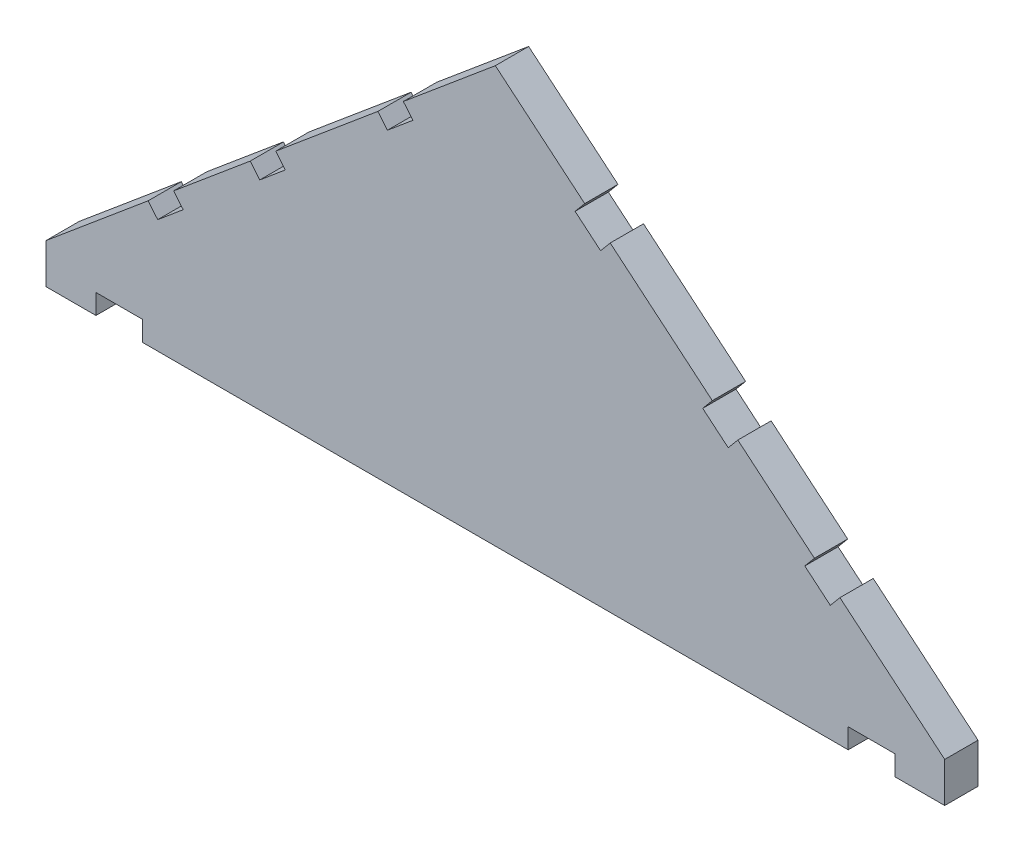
ISO-10303-21;
HEADER;
FILE_DESCRIPTION(('STEP AP214'),'2;1');
FILE_NAME('part.step','',(''),(''),'','','');
FILE_SCHEMA(('AUTOMOTIVE_DESIGN { 1 0 10303 214 1 1 1 1 }'));
ENDSEC;
DATA;
#1=APPLICATION_CONTEXT('core data for automotive mechanical design processes');
#2=APPLICATION_PROTOCOL_DEFINITION('international standard','automotive_design',2000,#1);
#3=PRODUCT_CONTEXT('',#1,'mechanical');
#4=PRODUCT('Part','Part','',(#3));
#5=PRODUCT_RELATED_PRODUCT_CATEGORY('part','',(#4));
#6=PRODUCT_DEFINITION_FORMATION('','',#4);
#7=PRODUCT_DEFINITION_CONTEXT('part definition',#1,'design');
#8=PRODUCT_DEFINITION('design','',#6,#7);
#9=PRODUCT_DEFINITION_SHAPE('','',#8);
#10=(LENGTH_UNIT() NAMED_UNIT(*) SI_UNIT(.MILLI.,.METRE.));
#11=(NAMED_UNIT(*) PLANE_ANGLE_UNIT() SI_UNIT($,.RADIAN.));
#12=(NAMED_UNIT(*) SI_UNIT($,.STERADIAN.) SOLID_ANGLE_UNIT());
#13=UNCERTAINTY_MEASURE_WITH_UNIT(LENGTH_MEASURE(1.E-05),#10,'distance_accuracy_value','');
#14=(GEOMETRIC_REPRESENTATION_CONTEXT(3) GLOBAL_UNCERTAINTY_ASSIGNED_CONTEXT((#13)) GLOBAL_UNIT_ASSIGNED_CONTEXT((#10,
#11,#12)) REPRESENTATION_CONTEXT('',''));
#15=CARTESIAN_POINT('',(0.,0.,0.));
#16=DIRECTION('',(0.,0.,1.));
#17=DIRECTION('',(1.,0.,0.));
#18=AXIS2_PLACEMENT_3D('',#15,#16,#17);
#19=CARTESIAN_POINT('',(68.4045773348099,-44.4964931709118,394.624391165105));
#20=DIRECTION('',(0.641858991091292,0.766822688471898,0.));
#21=DIRECTION('',(-0.766822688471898,0.641858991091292,0.));
#22=AXIS2_PLACEMENT_3D('',#19,#20,#21);
#23=PLANE('',#22);
#24=DIRECTION('',(0.,0.,1.));
#25=VECTOR('',#24,1.);
#26=CARTESIAN_POINT('',(171.925640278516,-131.147456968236,0.));
#27=LINE('',#26,#25);
#28=CARTESIAN_POINT('',(171.925640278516,-131.147456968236,0.));
#29=VERTEX_POINT('',#28);
#30=CARTESIAN_POINT('',(171.925640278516,-131.147456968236,10.));
#31=VERTEX_POINT('',#30);
#32=EDGE_CURVE('E926',#29,#31,#27,.T.);
#33=ORIENTED_EDGE('',*,*,#32,.T.);
#34=DIRECTION('',(0.766822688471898,-0.641858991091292,0.));
#35=VECTOR('',#34,1.);
#36=CARTESIAN_POINT('',(-10.9777224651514,21.9494318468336,10.));
#37=LINE('',#36,#35);
#38=CARTESIAN_POINT('',(203.40457733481,-157.496493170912,10.));
#39=VERTEX_POINT('',#38);
#40=EDGE_CURVE('E452',#31,#39,#37,.T.);
#41=ORIENTED_EDGE('',*,*,#40,.T.);
#42=DIRECTION('',(0.,0.,-1.));
#43=VECTOR('',#42,1.);
#44=CARTESIAN_POINT('',(203.40457733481,-157.496493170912,394.624391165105));
#45=LINE('',#44,#43);
#46=CARTESIAN_POINT('',(203.40457733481,-157.496493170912,0.));
#47=VERTEX_POINT('',#46);
#48=EDGE_CURVE('E445',#39,#47,#45,.T.);
#49=ORIENTED_EDGE('',*,*,#48,.T.);
#50=DIRECTION('',(0.766822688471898,-0.641858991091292,0.));
#51=VECTOR('',#50,1.);
#52=CARTESIAN_POINT('',(-10.9777224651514,21.9494318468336,0.));
#53=LINE('',#52,#51);
#54=EDGE_CURVE('E296',#29,#47,#53,.T.);
#55=ORIENTED_EDGE('',*,*,#54,.F.);
#56=EDGE_LOOP('',(#33,#41,#49,#55));
#57=FACE_BOUND('',#56,.T.);
#58=ADVANCED_FACE('F30',(#57),#23,.T.);
#59=DIRECTION('',(0.,0.,1.));
#60=VECTOR('',#59,1.);
#61=CARTESIAN_POINT('',(164.257413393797,-124.728867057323,0.));
#62=LINE('',#61,#60);
#63=CARTESIAN_POINT('',(164.257413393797,-124.728867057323,0.));
#64=VERTEX_POINT('',#63);
#65=CARTESIAN_POINT('',(164.257413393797,-124.728867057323,10.));
#66=VERTEX_POINT('',#65);
#67=EDGE_CURVE('E272',#64,#66,#62,.T.);
#68=ORIENTED_EDGE('',*,*,#67,.F.);
#69=CARTESIAN_POINT('',(141.25273273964,-105.473097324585,0.));
#70=VERTEX_POINT('',#69);
#71=EDGE_CURVE('E284',#70,#64,#53,.T.);
#72=ORIENTED_EDGE('',*,*,#71,.F.);
#73=DIRECTION('',(0.,0.,1.));
#74=VECTOR('',#73,1.);
#75=CARTESIAN_POINT('',(141.25273273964,-105.473097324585,0.));
#76=LINE('',#75,#74);
#77=CARTESIAN_POINT('',(141.25273273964,-105.473097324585,10.));
#78=VERTEX_POINT('',#77);
#79=EDGE_CURVE('E943',#70,#78,#76,.T.);
#80=ORIENTED_EDGE('',*,*,#79,.T.);
#81=EDGE_CURVE('E286',#78,#66,#37,.T.);
#82=ORIENTED_EDGE('',*,*,#81,.T.);
#83=EDGE_LOOP('',(#68,#72,#80,#82));
#84=FACE_BOUND('',#83,.T.);
#85=ADVANCED_FACE('F282',(#84),#23,.T.);
#86=CARTESIAN_POINT('',(-66.5954226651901,-44.4964931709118,10.));
#87=DIRECTION('',(0.,0.,-1.));
#88=DIRECTION('',(-1.,0.,0.));
#89=AXIS2_PLACEMENT_3D('',#86,#87,#88);
#90=PLANE('',#89);
#91=ORIENTED_EDGE('',*,*,#40,.F.);
#92=DIRECTION('',(0.641858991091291,0.766822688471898,0.));
#93=VECTOR('',#92,1.);
#94=CARTESIAN_POINT('',(169.037274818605,-134.59815906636,10.));
#95=LINE('',#94,#93);
#96=CARTESIAN_POINT('',(169.037274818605,-134.59815906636,10.));
#97=VERTEX_POINT('',#96);
#98=EDGE_CURVE('E277',#97,#31,#95,.T.);
#99=ORIENTED_EDGE('',*,*,#98,.F.);
#100=DIRECTION('',(0.766822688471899,-0.64185899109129,0.));
#101=VECTOR('',#100,1.);
#102=CARTESIAN_POINT('',(161.369047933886,-128.179569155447,10.));
#103=LINE('',#102,#101);
#104=CARTESIAN_POINT('',(161.369047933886,-128.179569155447,10.));
#105=VERTEX_POINT('',#104);
#106=EDGE_CURVE('E917',#105,#97,#103,.T.);
#107=ORIENTED_EDGE('',*,*,#106,.F.);
#108=DIRECTION('',(-0.641858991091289,-0.7668226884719,0.));
#109=VECTOR('',#108,1.);
#110=CARTESIAN_POINT('',(164.257413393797,-124.728867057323,10.));
#111=LINE('',#110,#109);
#112=EDGE_CURVE('E921',#66,#105,#111,.T.);
#113=ORIENTED_EDGE('',*,*,#112,.F.);
#114=ORIENTED_EDGE('',*,*,#81,.F.);
#115=DIRECTION('',(0.641858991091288,0.766822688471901,0.));
#116=VECTOR('',#115,1.);
#117=CARTESIAN_POINT('',(138.364367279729,-108.923799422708,10.));
#118=LINE('',#117,#116);
#119=CARTESIAN_POINT('',(138.364367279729,-108.923799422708,10.));
#120=VERTEX_POINT('',#119);
#121=EDGE_CURVE('E933',#120,#78,#118,.T.);
#122=ORIENTED_EDGE('',*,*,#121,.F.);
#123=DIRECTION('',(0.766822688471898,-0.641858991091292,0.));
#124=VECTOR('',#123,1.);
#125=CARTESIAN_POINT('',(130.69614039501,-102.505209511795,10.));
#126=LINE('',#125,#124);
#127=CARTESIAN_POINT('',(130.69614039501,-102.505209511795,10.));
#128=VERTEX_POINT('',#127);
#129=EDGE_CURVE('E939',#128,#120,#126,.T.);
#130=ORIENTED_EDGE('',*,*,#129,.F.);
#131=DIRECTION('',(-0.641858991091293,-0.766822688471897,0.));
#132=VECTOR('',#131,1.);
#133=CARTESIAN_POINT('',(133.584505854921,-99.0545074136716,10.));
#134=LINE('',#133,#132);
#135=CARTESIAN_POINT('',(133.584505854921,-99.0545074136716,10.));
#136=VERTEX_POINT('',#135);
#137=EDGE_CURVE('E928',#136,#128,#134,.T.);
#138=ORIENTED_EDGE('',*,*,#137,.F.);
#139=CARTESIAN_POINT('',(102.911598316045,-73.3801477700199,10.));
#140=VERTEX_POINT('',#139);
#141=EDGE_CURVE('E455',#140,#136,#37,.T.);
#142=ORIENTED_EDGE('',*,*,#141,.F.);
#143=DIRECTION('',(0.64185899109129,0.7668226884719,0.));
#144=VECTOR('',#143,1.);
#145=CARTESIAN_POINT('',(47.2938981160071,-139.826072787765,10.));
#146=LINE('',#145,#144);
#147=CARTESIAN_POINT('',(100.023232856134,-76.8308498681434,10.));
#148=VERTEX_POINT('',#147);
#149=EDGE_CURVE('E536',#148,#140,#146,.T.);
#150=ORIENTED_EDGE('',*,*,#149,.F.);
#151=DIRECTION('',(0.7668226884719,-0.641858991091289,0.));
#152=VECTOR('',#151,1.);
#153=CARTESIAN_POINT('',(-13.8660879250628,18.4987297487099,10.));
#154=LINE('',#153,#152);
#155=CARTESIAN_POINT('',(92.3550059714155,-70.4122599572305,10.));
#156=VERTEX_POINT('',#155);
#157=EDGE_CURVE('E530',#156,#148,#154,.T.);
#158=ORIENTED_EDGE('',*,*,#157,.F.);
#159=DIRECTION('',(-0.641858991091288,-0.766822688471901,0.));
#160=VECTOR('',#159,1.);
#161=CARTESIAN_POINT('',(39.6256712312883,-133.407482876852,10.));
#162=LINE('',#161,#160);
#163=CARTESIAN_POINT('',(95.2433714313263,-66.961557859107,10.));
#164=VERTEX_POINT('',#163);
#165=EDGE_CURVE('E528',#164,#156,#162,.T.);
#166=ORIENTED_EDGE('',*,*,#165,.F.);
#167=CARTESIAN_POINT('',(68.4045773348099,-44.4964931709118,10.));
#168=VERTEX_POINT('',#167);
#169=EDGE_CURVE('E320',#168,#164,#37,.T.);
#170=ORIENTED_EDGE('',*,*,#169,.F.);
#171=DIRECTION('',(0.766822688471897,0.641858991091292,0.));
#172=VECTOR('',#171,1.);
#173=CARTESIAN_POINT('',(-10.9777224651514,-110.942418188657,10.));
#174=LINE('',#173,#172);
#175=CARTESIAN_POINT('',(40.7597537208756,-67.6362344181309,10.));
#176=VERTEX_POINT('',#175);
#177=EDGE_CURVE('E454',#176,#168,#174,.T.);
#178=ORIENTED_EDGE('',*,*,#177,.F.);
#179=DIRECTION('',(-0.641858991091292,0.766822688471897,0.));
#180=VECTOR('',#179,1.);
#181=CARTESIAN_POINT('',(40.7597537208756,-67.6362344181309,10.));
#182=LINE('',#181,#180);
#183=CARTESIAN_POINT('',(43.6481191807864,-71.0869365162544,10.));
#184=VERTEX_POINT('',#183);
#185=EDGE_CURVE('E543',#184,#176,#182,.T.);
#186=ORIENTED_EDGE('',*,*,#185,.F.);
#187=DIRECTION('',(0.766822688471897,0.641858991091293,0.));
#188=VECTOR('',#187,1.);
#189=CARTESIAN_POINT('',(43.6481191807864,-71.0869365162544,10.));
#190=LINE('',#189,#188);
#191=CARTESIAN_POINT('',(35.9798922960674,-77.5055264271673,10.));
#192=VERTEX_POINT('',#191);
#193=EDGE_CURVE('E549',#192,#184,#190,.T.);
#194=ORIENTED_EDGE('',*,*,#193,.F.);
#195=DIRECTION('',(0.641858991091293,-0.766822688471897,0.));
#196=VECTOR('',#195,1.);
#197=CARTESIAN_POINT('',(35.9798922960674,-77.5055264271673,10.));
#198=LINE('',#197,#196);
#199=CARTESIAN_POINT('',(33.0915268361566,-74.0548243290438,10.));
#200=VERTEX_POINT('',#199);
#201=EDGE_CURVE('E534',#200,#192,#198,.T.);
#202=ORIENTED_EDGE('',*,*,#201,.F.);
#203=CARTESIAN_POINT('',(2.41861929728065,-99.7291839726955,10.));
#204=VERTEX_POINT('',#203);
#205=EDGE_CURVE('E518',#204,#200,#174,.T.);
#206=ORIENTED_EDGE('',*,*,#205,.F.);
#207=DIRECTION('',(-0.641858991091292,0.766822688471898,0.));
#208=VECTOR('',#207,1.);
#209=CARTESIAN_POINT('',(2.41861929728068,-99.7291839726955,10.));
#210=LINE('',#209,#208);
#211=CARTESIAN_POINT('',(5.30698475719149,-103.179886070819,10.));
#212=VERTEX_POINT('',#211);
#213=EDGE_CURVE('E368',#212,#204,#210,.T.);
#214=ORIENTED_EDGE('',*,*,#213,.F.);
#215=DIRECTION('',(0.766822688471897,0.641858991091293,0.));
#216=VECTOR('',#215,1.);
#217=CARTESIAN_POINT('',(5.30698475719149,-103.179886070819,10.));
#218=LINE('',#217,#216);
#219=CARTESIAN_POINT('',(-2.36124212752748,-109.598475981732,10.));
#220=VERTEX_POINT('',#219);
#221=EDGE_CURVE('E563',#220,#212,#218,.T.);
#222=ORIENTED_EDGE('',*,*,#221,.F.);
#223=DIRECTION('',(0.64185899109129,-0.766822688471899,0.));
#224=VECTOR('',#223,1.);
#225=CARTESIAN_POINT('',(-2.36124212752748,-109.598475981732,10.));
#226=LINE('',#225,#224);
#227=CARTESIAN_POINT('',(-5.24960758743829,-106.147773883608,10.));
#228=VERTEX_POINT('',#227);
#229=EDGE_CURVE('E517',#228,#220,#226,.T.);
#230=ORIENTED_EDGE('',*,*,#229,.F.);
#231=CARTESIAN_POINT('',(-28.2542882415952,-125.403543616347,10.));
#232=VERTEX_POINT('',#231);
#233=EDGE_CURVE('E354',#232,#228,#174,.T.);
#234=ORIENTED_EDGE('',*,*,#233,.F.);
#235=DIRECTION('',(-0.641858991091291,0.766822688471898,0.));
#236=VECTOR('',#235,1.);
#237=CARTESIAN_POINT('',(-28.2542882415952,-125.403543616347,10.));
#238=LINE('',#237,#236);
#239=CARTESIAN_POINT('',(-25.3659227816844,-128.854245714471,10.));
#240=VERTEX_POINT('',#239);
#241=EDGE_CURVE('E379',#240,#232,#238,.T.);
#242=ORIENTED_EDGE('',*,*,#241,.F.);
#243=DIRECTION('',(0.766822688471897,0.641858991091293,0.));
#244=VECTOR('',#243,1.);
#245=CARTESIAN_POINT('',(-25.3659227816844,-128.854245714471,10.));
#246=LINE('',#245,#244);
#247=CARTESIAN_POINT('',(-33.0341496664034,-135.272835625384,10.));
#248=VERTEX_POINT('',#247);
#249=EDGE_CURVE('E362',#248,#240,#246,.T.);
#250=ORIENTED_EDGE('',*,*,#249,.F.);
#251=DIRECTION('',(0.641858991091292,-0.766822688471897,0.));
#252=VECTOR('',#251,1.);
#253=CARTESIAN_POINT('',(-33.0341496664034,-135.272835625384,10.));
#254=LINE('',#253,#252);
#255=CARTESIAN_POINT('',(-35.9225151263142,-131.82213352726,10.));
#256=VERTEX_POINT('',#255);
#257=EDGE_CURVE('E358',#256,#248,#254,.T.);
#258=ORIENTED_EDGE('',*,*,#257,.F.);
#259=CARTESIAN_POINT('',(-66.5954226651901,-157.496493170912,10.));
#260=VERTEX_POINT('',#259);
#261=EDGE_CURVE('E456',#260,#256,#174,.T.);
#262=ORIENTED_EDGE('',*,*,#261,.F.);
#263=DIRECTION('',(0.,-1.,0.));
#264=VECTOR('',#263,1.);
#265=CARTESIAN_POINT('',(-66.5954226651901,-169.496493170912,10.));
#266=LINE('',#265,#264);
#267=CARTESIAN_POINT('',(-66.5954226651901,-169.496493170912,10.));
#268=VERTEX_POINT('',#267);
#269=EDGE_CURVE('E460',#260,#268,#266,.T.);
#270=ORIENTED_EDGE('',*,*,#269,.T.);
#271=DIRECTION('',(1.,0.,0.));
#272=VECTOR('',#271,1.);
#273=CARTESIAN_POINT('',(-66.5954226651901,-169.496493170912,10.));
#274=LINE('',#273,#272);
#275=CARTESIAN_POINT('',(-51.5954226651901,-169.496493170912,10.));
#276=VERTEX_POINT('',#275);
#277=EDGE_CURVE('E464',#268,#276,#274,.T.);
#278=ORIENTED_EDGE('',*,*,#277,.T.);
#279=DIRECTION('',(0.,-1.,0.));
#280=VECTOR('',#279,1.);
#281=CARTESIAN_POINT('',(-51.5954226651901,-169.496493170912,10.));
#282=LINE('',#281,#280);
#283=CARTESIAN_POINT('',(-51.5954226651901,-163.496493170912,10.));
#284=VERTEX_POINT('',#283);
#285=EDGE_CURVE('E412',#284,#276,#282,.T.);
#286=ORIENTED_EDGE('',*,*,#285,.F.);
#287=DIRECTION('',(-1.,0.,0.));
#288=VECTOR('',#287,1.);
#289=CARTESIAN_POINT('',(-51.5954226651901,-163.496493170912,10.));
#290=LINE('',#289,#288);
#291=CARTESIAN_POINT('',(-37.5954226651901,-163.496493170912,10.));
#292=VERTEX_POINT('',#291);
#293=EDGE_CURVE('E423',#292,#284,#290,.T.);
#294=ORIENTED_EDGE('',*,*,#293,.F.);
#295=DIRECTION('',(0.,1.,0.));
#296=VECTOR('',#295,1.);
#297=CARTESIAN_POINT('',(-37.5954226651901,-169.496493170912,10.));
#298=LINE('',#297,#296);
#299=CARTESIAN_POINT('',(-37.5954226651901,-169.496493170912,10.));
#300=VERTEX_POINT('',#299);
#301=EDGE_CURVE('E431',#300,#292,#298,.T.);
#302=ORIENTED_EDGE('',*,*,#301,.F.);
#303=CARTESIAN_POINT('',(174.40457733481,-169.496493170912,10.));
#304=VERTEX_POINT('',#303);
#305=EDGE_CURVE('E468',#300,#304,#274,.T.);
#306=ORIENTED_EDGE('',*,*,#305,.T.);
#307=DIRECTION('',(0.,-1.,0.));
#308=VECTOR('',#307,1.);
#309=CARTESIAN_POINT('',(174.40457733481,-169.496493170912,10.));
#310=LINE('',#309,#308);
#311=CARTESIAN_POINT('',(174.40457733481,-163.496493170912,10.));
#312=VERTEX_POINT('',#311);
#313=EDGE_CURVE('E388',#312,#304,#310,.T.);
#314=ORIENTED_EDGE('',*,*,#313,.F.);
#315=DIRECTION('',(-1.,0.,0.));
#316=VECTOR('',#315,1.);
#317=CARTESIAN_POINT('',(174.40457733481,-163.496493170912,10.));
#318=LINE('',#317,#316);
#319=CARTESIAN_POINT('',(188.40457733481,-163.496493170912,10.));
#320=VERTEX_POINT('',#319);
#321=EDGE_CURVE('E397',#320,#312,#318,.T.);
#322=ORIENTED_EDGE('',*,*,#321,.F.);
#323=DIRECTION('',(0.,1.,0.));
#324=VECTOR('',#323,1.);
#325=CARTESIAN_POINT('',(188.40457733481,-169.496493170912,10.));
#326=LINE('',#325,#324);
#327=CARTESIAN_POINT('',(188.40457733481,-169.496493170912,10.));
#328=VERTEX_POINT('',#327);
#329=EDGE_CURVE('E405',#328,#320,#326,.T.);
#330=ORIENTED_EDGE('',*,*,#329,.F.);
#331=CARTESIAN_POINT('',(203.40457733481,-169.496493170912,10.));
#332=VERTEX_POINT('',#331);
#333=EDGE_CURVE('E462',#328,#332,#274,.T.);
#334=ORIENTED_EDGE('',*,*,#333,.T.);
#335=DIRECTION('',(0.,1.,0.));
#336=VECTOR('',#335,1.);
#337=CARTESIAN_POINT('',(203.40457733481,-169.496493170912,10.));
#338=LINE('',#337,#336);
#339=EDGE_CURVE('E467',#332,#39,#338,.T.);
#340=ORIENTED_EDGE('',*,*,#339,.T.);
#341=EDGE_LOOP('',(#91,#99,#107,#113,#114,#122,#130,#138,#142,#150,#158,#166,#170,#178,#186,
#194,#202,#206,#214,#222,#230,#234,#242,#250,#258,#262,#270,#278,#286,#294,#302,#306,#314,#322,
#330,#334,#340));
#342=FACE_BOUND('',#341,.T.);
#343=ADVANCED_FACE('F500',(#342),#90,.F.);
#344=CARTESIAN_POINT('',(-66.5954226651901,-44.4964931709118,0.));
#345=DIRECTION('',(0.,0.,-1.));
#346=DIRECTION('',(-1.,0.,0.));
#347=AXIS2_PLACEMENT_3D('',#344,#345,#346);
#348=PLANE('',#347);
#349=DIRECTION('',(0.641858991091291,0.766822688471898,0.));
#350=VECTOR('',#349,1.);
#351=CARTESIAN_POINT('',(169.037274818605,-134.59815906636,0.));
#352=LINE('',#351,#350);
#353=CARTESIAN_POINT('',(169.037274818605,-134.59815906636,0.));
#354=VERTEX_POINT('',#353);
#355=EDGE_CURVE('E287',#354,#29,#352,.T.);
#356=ORIENTED_EDGE('',*,*,#355,.T.);
#357=ORIENTED_EDGE('',*,*,#54,.T.);
#358=DIRECTION('',(0.,1.,0.));
#359=VECTOR('',#358,1.);
#360=CARTESIAN_POINT('',(203.40457733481,-169.496493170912,0.));
#361=LINE('',#360,#359);
#362=CARTESIAN_POINT('',(203.40457733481,-169.496493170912,0.));
#363=VERTEX_POINT('',#362);
#364=EDGE_CURVE('E463',#363,#47,#361,.T.);
#365=ORIENTED_EDGE('',*,*,#364,.F.);
#366=DIRECTION('',(1.,0.,0.));
#367=VECTOR('',#366,1.);
#368=CARTESIAN_POINT('',(-66.5954226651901,-169.496493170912,0.));
#369=LINE('',#368,#367);
#370=CARTESIAN_POINT('',(188.40457733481,-169.496493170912,0.));
#371=VERTEX_POINT('',#370);
#372=EDGE_CURVE('E473',#371,#363,#369,.T.);
#373=ORIENTED_EDGE('',*,*,#372,.F.);
#374=DIRECTION('',(0.,1.,0.));
#375=VECTOR('',#374,1.);
#376=CARTESIAN_POINT('',(188.40457733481,-169.496493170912,0.));
#377=LINE('',#376,#375);
#378=CARTESIAN_POINT('',(188.40457733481,-163.496493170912,0.));
#379=VERTEX_POINT('',#378);
#380=EDGE_CURVE('E396',#371,#379,#377,.T.);
#381=ORIENTED_EDGE('',*,*,#380,.T.);
#382=DIRECTION('',(-1.,0.,0.));
#383=VECTOR('',#382,1.);
#384=CARTESIAN_POINT('',(174.40457733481,-163.496493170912,0.));
#385=LINE('',#384,#383);
#386=CARTESIAN_POINT('',(174.40457733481,-163.496493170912,0.));
#387=VERTEX_POINT('',#386);
#388=EDGE_CURVE('E400',#379,#387,#385,.T.);
#389=ORIENTED_EDGE('',*,*,#388,.T.);
#390=DIRECTION('',(0.,-1.,0.));
#391=VECTOR('',#390,1.);
#392=CARTESIAN_POINT('',(174.40457733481,-169.496493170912,0.));
#393=LINE('',#392,#391);
#394=CARTESIAN_POINT('',(174.40457733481,-169.496493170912,0.));
#395=VERTEX_POINT('',#394);
#396=EDGE_CURVE('E393',#387,#395,#393,.T.);
#397=ORIENTED_EDGE('',*,*,#396,.T.);
#398=CARTESIAN_POINT('',(-37.5954226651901,-169.496493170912,0.));
#399=VERTEX_POINT('',#398);
#400=EDGE_CURVE('E477',#399,#395,#369,.T.);
#401=ORIENTED_EDGE('',*,*,#400,.F.);
#402=DIRECTION('',(0.,1.,0.));
#403=VECTOR('',#402,1.);
#404=CARTESIAN_POINT('',(-37.5954226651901,-169.496493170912,0.));
#405=LINE('',#404,#403);
#406=CARTESIAN_POINT('',(-37.5954226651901,-163.496493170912,0.));
#407=VERTEX_POINT('',#406);
#408=EDGE_CURVE('E422',#399,#407,#405,.T.);
#409=ORIENTED_EDGE('',*,*,#408,.T.);
#410=DIRECTION('',(-1.,0.,0.));
#411=VECTOR('',#410,1.);
#412=CARTESIAN_POINT('',(-51.5954226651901,-163.496493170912,0.));
#413=LINE('',#412,#411);
#414=CARTESIAN_POINT('',(-51.5954226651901,-163.496493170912,0.));
#415=VERTEX_POINT('',#414);
#416=EDGE_CURVE('E426',#407,#415,#413,.T.);
#417=ORIENTED_EDGE('',*,*,#416,.T.);
#418=DIRECTION('',(0.,-1.,0.));
#419=VECTOR('',#418,1.);
#420=CARTESIAN_POINT('',(-51.5954226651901,-169.496493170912,0.));
#421=LINE('',#420,#419);
#422=CARTESIAN_POINT('',(-51.5954226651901,-169.496493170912,0.));
#423=VERTEX_POINT('',#422);
#424=EDGE_CURVE('E419',#415,#423,#421,.T.);
#425=ORIENTED_EDGE('',*,*,#424,.T.);
#426=CARTESIAN_POINT('',(-66.5954226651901,-169.496493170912,0.));
#427=VERTEX_POINT('',#426);
#428=EDGE_CURVE('E474',#427,#423,#369,.T.);
#429=ORIENTED_EDGE('',*,*,#428,.F.);
#430=DIRECTION('',(0.,-1.,0.));
#431=VECTOR('',#430,1.);
#432=CARTESIAN_POINT('',(-66.5954226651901,-169.496493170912,0.));
#433=LINE('',#432,#431);
#434=CARTESIAN_POINT('',(-66.5954226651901,-157.496493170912,0.));
#435=VERTEX_POINT('',#434);
#436=EDGE_CURVE('E459',#435,#427,#433,.T.);
#437=ORIENTED_EDGE('',*,*,#436,.F.);
#438=DIRECTION('',(0.766822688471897,0.641858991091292,0.));
#439=VECTOR('',#438,1.);
#440=CARTESIAN_POINT('',(-10.9777224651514,-110.942418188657,0.));
#441=LINE('',#440,#439);
#442=CARTESIAN_POINT('',(-35.9225151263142,-131.82213352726,0.));
#443=VERTEX_POINT('',#442);
#444=EDGE_CURVE('E306',#435,#443,#441,.T.);
#445=ORIENTED_EDGE('',*,*,#444,.T.);
#446=DIRECTION('',(0.641858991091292,-0.766822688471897,0.));
#447=VECTOR('',#446,1.);
#448=CARTESIAN_POINT('',(-33.0341496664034,-135.272835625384,0.));
#449=LINE('',#448,#447);
#450=CARTESIAN_POINT('',(-33.0341496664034,-135.272835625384,0.));
#451=VERTEX_POINT('',#450);
#452=EDGE_CURVE('E375',#443,#451,#449,.T.);
#453=ORIENTED_EDGE('',*,*,#452,.T.);
#454=DIRECTION('',(0.766822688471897,0.641858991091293,0.));
#455=VECTOR('',#454,1.);
#456=CARTESIAN_POINT('',(-25.3659227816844,-128.854245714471,0.));
#457=LINE('',#456,#455);
#458=CARTESIAN_POINT('',(-25.3659227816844,-128.854245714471,0.));
#459=VERTEX_POINT('',#458);
#460=EDGE_CURVE('E378',#451,#459,#457,.T.);
#461=ORIENTED_EDGE('',*,*,#460,.T.);
#462=DIRECTION('',(-0.641858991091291,0.766822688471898,0.));
#463=VECTOR('',#462,1.);
#464=CARTESIAN_POINT('',(-28.2542882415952,-125.403543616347,0.));
#465=LINE('',#464,#463);
#466=CARTESIAN_POINT('',(-28.2542882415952,-125.403543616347,0.));
#467=VERTEX_POINT('',#466);
#468=EDGE_CURVE('E345',#459,#467,#465,.T.);
#469=ORIENTED_EDGE('',*,*,#468,.T.);
#470=CARTESIAN_POINT('',(-5.24960758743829,-106.147773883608,0.));
#471=VERTEX_POINT('',#470);
#472=EDGE_CURVE('E310',#467,#471,#441,.T.);
#473=ORIENTED_EDGE('',*,*,#472,.T.);
#474=DIRECTION('',(0.64185899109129,-0.766822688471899,0.));
#475=VECTOR('',#474,1.);
#476=CARTESIAN_POINT('',(-2.36124212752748,-109.598475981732,0.));
#477=LINE('',#476,#475);
#478=CARTESIAN_POINT('',(-2.36124212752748,-109.598475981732,0.));
#479=VERTEX_POINT('',#478);
#480=EDGE_CURVE('E342',#471,#479,#477,.T.);
#481=ORIENTED_EDGE('',*,*,#480,.T.);
#482=DIRECTION('',(0.766822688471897,0.641858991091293,0.));
#483=VECTOR('',#482,1.);
#484=CARTESIAN_POINT('',(5.30698475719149,-103.179886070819,0.));
#485=LINE('',#484,#483);
#486=CARTESIAN_POINT('',(5.30698475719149,-103.179886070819,0.));
#487=VERTEX_POINT('',#486);
#488=EDGE_CURVE('E560',#479,#487,#485,.T.);
#489=ORIENTED_EDGE('',*,*,#488,.T.);
#490=DIRECTION('',(-0.641858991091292,0.766822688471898,0.));
#491=VECTOR('',#490,1.);
#492=CARTESIAN_POINT('',(2.41861929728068,-99.7291839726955,0.));
#493=LINE('',#492,#491);
#494=CARTESIAN_POINT('',(2.41861929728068,-99.7291839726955,0.));
#495=VERTEX_POINT('',#494);
#496=EDGE_CURVE('E374',#487,#495,#493,.T.);
#497=ORIENTED_EDGE('',*,*,#496,.T.);
#498=CARTESIAN_POINT('',(33.0915268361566,-74.0548243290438,0.));
#499=VERTEX_POINT('',#498);
#500=EDGE_CURVE('E332',#495,#499,#441,.T.);
#501=ORIENTED_EDGE('',*,*,#500,.T.);
#502=DIRECTION('',(0.641858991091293,-0.766822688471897,0.));
#503=VECTOR('',#502,1.);
#504=CARTESIAN_POINT('',(35.9798922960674,-77.5055264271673,0.));
#505=LINE('',#504,#503);
#506=CARTESIAN_POINT('',(35.9798922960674,-77.5055264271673,0.));
#507=VERTEX_POINT('',#506);
#508=EDGE_CURVE('E540',#499,#507,#505,.T.);
#509=ORIENTED_EDGE('',*,*,#508,.T.);
#510=DIRECTION('',(0.766822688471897,0.641858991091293,0.));
#511=VECTOR('',#510,1.);
#512=CARTESIAN_POINT('',(43.6481191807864,-71.0869365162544,0.));
#513=LINE('',#512,#511);
#514=CARTESIAN_POINT('',(43.6481191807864,-71.0869365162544,0.));
#515=VERTEX_POINT('',#514);
#516=EDGE_CURVE('E542',#507,#515,#513,.T.);
#517=ORIENTED_EDGE('',*,*,#516,.T.);
#518=DIRECTION('',(-0.641858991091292,0.766822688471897,0.));
#519=VECTOR('',#518,1.);
#520=CARTESIAN_POINT('',(40.7597537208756,-67.6362344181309,0.));
#521=LINE('',#520,#519);
#522=CARTESIAN_POINT('',(40.7597537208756,-67.6362344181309,0.));
#523=VERTEX_POINT('',#522);
#524=EDGE_CURVE('E329',#515,#523,#521,.T.);
#525=ORIENTED_EDGE('',*,*,#524,.T.);
#526=CARTESIAN_POINT('',(68.4045773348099,-44.4964931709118,0.));
#527=VERTEX_POINT('',#526);
#528=EDGE_CURVE('E304',#523,#527,#441,.T.);
#529=ORIENTED_EDGE('',*,*,#528,.T.);
#530=CARTESIAN_POINT('',(95.2433714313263,-66.961557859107,0.));
#531=VERTEX_POINT('',#530);
#532=EDGE_CURVE('E299',#527,#531,#53,.T.);
#533=ORIENTED_EDGE('',*,*,#532,.T.);
#534=DIRECTION('',(-0.641858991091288,-0.766822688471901,0.));
#535=VECTOR('',#534,1.);
#536=CARTESIAN_POINT('',(39.6256712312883,-133.407482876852,0.));
#537=LINE('',#536,#535);
#538=CARTESIAN_POINT('',(92.3550059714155,-70.4122599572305,0.));
#539=VERTEX_POINT('',#538);
#540=EDGE_CURVE('E324',#531,#539,#537,.T.);
#541=ORIENTED_EDGE('',*,*,#540,.T.);
#542=DIRECTION('',(0.7668226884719,-0.641858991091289,0.));
#543=VECTOR('',#542,1.);
#544=CARTESIAN_POINT('',(-13.8660879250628,18.4987297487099,0.));
#545=LINE('',#544,#543);
#546=CARTESIAN_POINT('',(100.023232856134,-76.8308498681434,0.));
#547=VERTEX_POINT('',#546);
#548=EDGE_CURVE('E11',#539,#547,#545,.T.);
#549=ORIENTED_EDGE('',*,*,#548,.T.);
#550=DIRECTION('',(0.64185899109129,0.7668226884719,0.));
#551=VECTOR('',#550,1.);
#552=CARTESIAN_POINT('',(47.2938981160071,-139.826072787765,0.));
#553=LINE('',#552,#551);
#554=CARTESIAN_POINT('',(102.911598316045,-73.3801477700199,0.));
#555=VERTEX_POINT('',#554);
#556=EDGE_CURVE('E955',#547,#555,#553,.T.);
#557=ORIENTED_EDGE('',*,*,#556,.T.);
#558=CARTESIAN_POINT('',(133.584505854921,-99.0545074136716,0.));
#559=VERTEX_POINT('',#558);
#560=EDGE_CURVE('E295',#555,#559,#53,.T.);
#561=ORIENTED_EDGE('',*,*,#560,.T.);
#562=DIRECTION('',(-0.641858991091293,-0.766822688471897,0.));
#563=VECTOR('',#562,1.);
#564=CARTESIAN_POINT('',(133.584505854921,-99.0545074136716,0.));
#565=LINE('',#564,#563);
#566=CARTESIAN_POINT('',(130.69614039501,-102.505209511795,0.));
#567=VERTEX_POINT('',#566);
#568=EDGE_CURVE('E53',#559,#567,#565,.T.);
#569=ORIENTED_EDGE('',*,*,#568,.T.);
#570=DIRECTION('',(0.766822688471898,-0.641858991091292,0.));
#571=VECTOR('',#570,1.);
#572=CARTESIAN_POINT('',(130.69614039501,-102.505209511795,0.));
#573=LINE('',#572,#571);
#574=CARTESIAN_POINT('',(138.364367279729,-108.923799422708,0.));
#575=VERTEX_POINT('',#574);
#576=EDGE_CURVE('E932',#567,#575,#573,.T.);
#577=ORIENTED_EDGE('',*,*,#576,.T.);
#578=DIRECTION('',(0.641858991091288,0.766822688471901,0.));
#579=VECTOR('',#578,1.);
#580=CARTESIAN_POINT('',(138.364367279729,-108.923799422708,0.));
#581=LINE('',#580,#579);
#582=EDGE_CURVE('E294',#575,#70,#581,.T.);
#583=ORIENTED_EDGE('',*,*,#582,.T.);
#584=ORIENTED_EDGE('',*,*,#71,.T.);
#585=DIRECTION('',(-0.641858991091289,-0.7668226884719,0.));
#586=VECTOR('',#585,1.);
#587=CARTESIAN_POINT('',(164.257413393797,-124.728867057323,0.));
#588=LINE('',#587,#586);
#589=CARTESIAN_POINT('',(161.369047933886,-128.179569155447,0.));
#590=VERTEX_POINT('',#589);
#591=EDGE_CURVE('E268',#64,#590,#588,.T.);
#592=ORIENTED_EDGE('',*,*,#591,.T.);
#593=DIRECTION('',(0.766822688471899,-0.64185899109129,0.));
#594=VECTOR('',#593,1.);
#595=CARTESIAN_POINT('',(161.369047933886,-128.179569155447,0.));
#596=LINE('',#595,#594);
#597=EDGE_CURVE('E45',#590,#354,#596,.T.);
#598=ORIENTED_EDGE('',*,*,#597,.T.);
#599=EDGE_LOOP('',(#356,#357,#365,#373,#381,#389,#397,#401,#409,#417,#425,#429,#437,#445,#453,
#461,#469,#473,#481,#489,#497,#501,#509,#517,#525,#529,#533,#541,#549,#557,#561,#569,#577,#583,
#584,#592,#598));
#600=FACE_BOUND('',#599,.T.);
#601=ADVANCED_FACE('F291',(#600),#348,.T.);
#602=ORIENTED_EDGE('',*,*,#169,.T.);
#603=DIRECTION('',(0.,0.,-1.));
#604=VECTOR('',#603,1.);
#605=CARTESIAN_POINT('',(95.2433714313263,-66.961557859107,394.624391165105));
#606=LINE('',#605,#604);
#607=EDGE_CURVE('E38',#164,#531,#606,.T.);
#608=ORIENTED_EDGE('',*,*,#607,.T.);
#609=ORIENTED_EDGE('',*,*,#532,.F.);
#610=DIRECTION('',(0.,0.,-1.));
#611=VECTOR('',#610,1.);
#612=CARTESIAN_POINT('',(68.4045773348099,-44.4964931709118,394.624391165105));
#613=LINE('',#612,#611);
#614=EDGE_CURVE('E438',#168,#527,#613,.T.);
#615=ORIENTED_EDGE('',*,*,#614,.F.);
#616=EDGE_LOOP('',(#602,#608,#609,#615));
#617=FACE_BOUND('',#616,.T.);
#618=ADVANCED_FACE('F316',(#617),#23,.T.);
#619=DIRECTION('',(0.,0.,1.));
#620=VECTOR('',#619,1.);
#621=CARTESIAN_POINT('',(133.584505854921,-99.0545074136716,0.));
#622=LINE('',#621,#620);
#623=EDGE_CURVE('E936',#559,#136,#622,.T.);
#624=ORIENTED_EDGE('',*,*,#623,.F.);
#625=ORIENTED_EDGE('',*,*,#560,.F.);
#626=DIRECTION('',(0.,0.,1.));
#627=VECTOR('',#626,1.);
#628=CARTESIAN_POINT('',(102.911598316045,-73.3801477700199,394.624391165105));
#629=LINE('',#628,#627);
#630=EDGE_CURVE('E309',#555,#140,#629,.T.);
#631=ORIENTED_EDGE('',*,*,#630,.T.);
#632=ORIENTED_EDGE('',*,*,#141,.T.);
#633=EDGE_LOOP('',(#624,#625,#631,#632));
#634=FACE_BOUND('',#633,.T.);
#635=ADVANCED_FACE('F597',(#634),#23,.T.);
#636=CARTESIAN_POINT('',(-66.5954226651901,-157.496493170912,394.624391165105));
#637=DIRECTION('',(-0.641858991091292,0.766822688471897,0.));
#638=DIRECTION('',(-0.766822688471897,-0.641858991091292,0.));
#639=AXIS2_PLACEMENT_3D('',#636,#637,#638);
#640=PLANE('',#639);
#641=DIRECTION('',(0.,0.,1.));
#642=VECTOR('',#641,1.);
#643=CARTESIAN_POINT('',(33.0915268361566,-74.0548243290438,0.));
#644=LINE('',#643,#642);
#645=EDGE_CURVE('E553',#499,#200,#644,.T.);
#646=ORIENTED_EDGE('',*,*,#645,.F.);
#647=ORIENTED_EDGE('',*,*,#500,.F.);
#648=DIRECTION('',(0.,0.,1.));
#649=VECTOR('',#648,1.);
#650=CARTESIAN_POINT('',(2.41861929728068,-99.7291839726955,0.));
#651=LINE('',#650,#649);
#652=EDGE_CURVE('E359',#495,#204,#651,.T.);
#653=ORIENTED_EDGE('',*,*,#652,.T.);
#654=ORIENTED_EDGE('',*,*,#205,.T.);
#655=EDGE_LOOP('',(#646,#647,#653,#654));
#656=FACE_BOUND('',#655,.T.);
#657=ADVANCED_FACE('F570',(#656),#640,.T.);
#658=DIRECTION('',(0.,0.,1.));
#659=VECTOR('',#658,1.);
#660=CARTESIAN_POINT('',(-5.24960758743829,-106.147773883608,0.));
#661=LINE('',#660,#659);
#662=EDGE_CURVE('E353',#471,#228,#661,.T.);
#663=ORIENTED_EDGE('',*,*,#662,.F.);
#664=ORIENTED_EDGE('',*,*,#472,.F.);
#665=DIRECTION('',(0.,0.,1.));
#666=VECTOR('',#665,1.);
#667=CARTESIAN_POINT('',(-28.2542882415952,-125.403543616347,0.));
#668=LINE('',#667,#666);
#669=EDGE_CURVE('E351',#467,#232,#668,.T.);
#670=ORIENTED_EDGE('',*,*,#669,.T.);
#671=ORIENTED_EDGE('',*,*,#233,.T.);
#672=EDGE_LOOP('',(#663,#664,#670,#671));
#673=FACE_BOUND('',#672,.T.);
#674=ADVANCED_FACE('F349',(#673),#640,.T.);
#675=DIRECTION('',(0.,0.,1.));
#676=VECTOR('',#675,1.);
#677=CARTESIAN_POINT('',(-35.9225151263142,-131.82213352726,0.));
#678=LINE('',#677,#676);
#679=EDGE_CURVE('E386',#443,#256,#678,.T.);
#680=ORIENTED_EDGE('',*,*,#679,.F.);
#681=ORIENTED_EDGE('',*,*,#444,.F.);
#682=DIRECTION('',(0.,0.,-1.));
#683=VECTOR('',#682,1.);
#684=CARTESIAN_POINT('',(-66.5954226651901,-157.496493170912,394.624391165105));
#685=LINE('',#684,#683);
#686=EDGE_CURVE('E448',#260,#435,#685,.T.);
#687=ORIENTED_EDGE('',*,*,#686,.F.);
#688=ORIENTED_EDGE('',*,*,#261,.T.);
#689=EDGE_LOOP('',(#680,#681,#687,#688));
#690=FACE_BOUND('',#689,.T.);
#691=ADVANCED_FACE('F507',(#690),#640,.T.);
#692=CARTESIAN_POINT('',(-66.5954226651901,-169.496493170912,10.));
#693=DIRECTION('',(0.,1.,0.));
#694=DIRECTION('',(0.,0.,1.));
#695=AXIS2_PLACEMENT_3D('',#692,#693,#694);
#696=PLANE('',#695);
#697=ORIENTED_EDGE('',*,*,#400,.T.);
#698=DIRECTION('',(0.,0.,1.));
#699=VECTOR('',#698,1.);
#700=CARTESIAN_POINT('',(174.40457733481,-169.496493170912,0.));
#701=LINE('',#700,#699);
#702=EDGE_CURVE('E403',#395,#304,#701,.T.);
#703=ORIENTED_EDGE('',*,*,#702,.T.);
#704=ORIENTED_EDGE('',*,*,#305,.F.);
#705=DIRECTION('',(0.,0.,1.));
#706=VECTOR('',#705,1.);
#707=CARTESIAN_POINT('',(-37.5954226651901,-169.496493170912,0.));
#708=LINE('',#707,#706);
#709=EDGE_CURVE('E441',#399,#300,#708,.T.);
#710=ORIENTED_EDGE('',*,*,#709,.F.);
#711=EDGE_LOOP('',(#697,#703,#704,#710));
#712=FACE_BOUND('',#711,.T.);
#713=ADVANCED_FACE('F618',(#712),#696,.F.);
#714=ORIENTED_EDGE('',*,*,#428,.T.);
#715=DIRECTION('',(0.,0.,1.));
#716=VECTOR('',#715,1.);
#717=CARTESIAN_POINT('',(-51.5954226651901,-169.496493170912,0.));
#718=LINE('',#717,#716);
#719=EDGE_CURVE('E429',#423,#276,#718,.T.);
#720=ORIENTED_EDGE('',*,*,#719,.T.);
#721=ORIENTED_EDGE('',*,*,#277,.F.);
#722=DIRECTION('',(0.,0.,-1.));
#723=VECTOR('',#722,1.);
#724=CARTESIAN_POINT('',(-66.5954226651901,-169.496493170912,10.));
#725=LINE('',#724,#723);
#726=EDGE_CURVE('E300',#268,#427,#725,.T.);
#727=ORIENTED_EDGE('',*,*,#726,.T.);
#728=EDGE_LOOP('',(#714,#720,#721,#727));
#729=FACE_BOUND('',#728,.T.);
#730=ADVANCED_FACE('F488',(#729),#696,.F.);
#731=CARTESIAN_POINT('',(-66.5954226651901,-169.496493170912,10.));
#732=DIRECTION('',(1.,0.,0.));
#733=DIRECTION('',(0.,0.,-1.));
#734=AXIS2_PLACEMENT_3D('',#731,#732,#733);
#735=PLANE('',#734);
#736=ORIENTED_EDGE('',*,*,#686,.T.);
#737=ORIENTED_EDGE('',*,*,#436,.T.);
#738=ORIENTED_EDGE('',*,*,#726,.F.);
#739=ORIENTED_EDGE('',*,*,#269,.F.);
#740=EDGE_LOOP('',(#736,#737,#738,#739));
#741=FACE_BOUND('',#740,.T.);
#742=ADVANCED_FACE('F32',(#741),#735,.F.);
#743=CARTESIAN_POINT('',(203.40457733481,-169.496493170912,10.));
#744=DIRECTION('',(-1.,0.,0.));
#745=DIRECTION('',(0.,-1.,0.));
#746=AXIS2_PLACEMENT_3D('',#743,#744,#745);
#747=PLANE('',#746);
#748=ORIENTED_EDGE('',*,*,#48,.F.);
#749=ORIENTED_EDGE('',*,*,#339,.F.);
#750=DIRECTION('',(0.,0.,-1.));
#751=VECTOR('',#750,1.);
#752=CARTESIAN_POINT('',(203.40457733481,-169.496493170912,10.));
#753=LINE('',#752,#751);
#754=EDGE_CURVE('E471',#332,#363,#753,.T.);
#755=ORIENTED_EDGE('',*,*,#754,.T.);
#756=ORIENTED_EDGE('',*,*,#364,.T.);
#757=EDGE_LOOP('',(#748,#749,#755,#756));
#758=FACE_BOUND('',#757,.T.);
#759=ADVANCED_FACE('F613',(#758),#747,.F.);
#760=ORIENTED_EDGE('',*,*,#333,.F.);
#761=DIRECTION('',(0.,0.,1.));
#762=VECTOR('',#761,1.);
#763=CARTESIAN_POINT('',(188.40457733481,-169.496493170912,0.));
#764=LINE('',#763,#762);
#765=EDGE_CURVE('E415',#371,#328,#764,.T.);
#766=ORIENTED_EDGE('',*,*,#765,.F.);
#767=ORIENTED_EDGE('',*,*,#372,.T.);
#768=ORIENTED_EDGE('',*,*,#754,.F.);
#769=EDGE_LOOP('',(#760,#766,#767,#768));
#770=FACE_BOUND('',#769,.T.);
#771=ADVANCED_FACE('F615',(#770),#696,.F.);
#772=DIRECTION('',(0.,0.,1.));
#773=VECTOR('',#772,1.);
#774=CARTESIAN_POINT('',(40.7597537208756,-67.6362344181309,0.));
#775=LINE('',#774,#773);
#776=EDGE_CURVE('E525',#523,#176,#775,.T.);
#777=ORIENTED_EDGE('',*,*,#776,.T.);
#778=ORIENTED_EDGE('',*,*,#177,.T.);
#779=ORIENTED_EDGE('',*,*,#614,.T.);
#780=ORIENTED_EDGE('',*,*,#528,.F.);
#781=EDGE_LOOP('',(#777,#778,#779,#780));
#782=FACE_BOUND('',#781,.T.);
#783=ADVANCED_FACE('F524',(#782),#640,.T.);
#784=CARTESIAN_POINT('',(-51.5954226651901,-169.496493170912,0.));
#785=DIRECTION('',(-1.,0.,0.));
#786=DIRECTION('',(0.,0.,1.));
#787=AXIS2_PLACEMENT_3D('',#784,#785,#786);
#788=PLANE('',#787);
#789=ORIENTED_EDGE('',*,*,#285,.T.);
#790=ORIENTED_EDGE('',*,*,#719,.F.);
#791=ORIENTED_EDGE('',*,*,#424,.F.);
#792=DIRECTION('',(0.,0.,1.));
#793=VECTOR('',#792,1.);
#794=CARTESIAN_POINT('',(-51.5954226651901,-163.496493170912,0.));
#795=LINE('',#794,#793);
#796=EDGE_CURVE('E436',#415,#284,#795,.T.);
#797=ORIENTED_EDGE('',*,*,#796,.T.);
#798=EDGE_LOOP('',(#789,#790,#791,#797));
#799=FACE_BOUND('',#798,.T.);
#800=ADVANCED_FACE('F496',(#799),#788,.F.);
#801=CARTESIAN_POINT('',(-51.5954226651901,-163.496493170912,0.));
#802=DIRECTION('',(0.,1.,0.));
#803=DIRECTION('',(0.,0.,1.));
#804=AXIS2_PLACEMENT_3D('',#801,#802,#803);
#805=PLANE('',#804);
#806=ORIENTED_EDGE('',*,*,#293,.T.);
#807=ORIENTED_EDGE('',*,*,#796,.F.);
#808=ORIENTED_EDGE('',*,*,#416,.F.);
#809=DIRECTION('',(0.,0.,1.));
#810=VECTOR('',#809,1.);
#811=CARTESIAN_POINT('',(-37.5954226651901,-163.496493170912,0.));
#812=LINE('',#811,#810);
#813=EDGE_CURVE('E439',#407,#292,#812,.T.);
#814=ORIENTED_EDGE('',*,*,#813,.T.);
#815=EDGE_LOOP('',(#806,#807,#808,#814));
#816=FACE_BOUND('',#815,.T.);
#817=ADVANCED_FACE('F660',(#816),#805,.F.);
#818=CARTESIAN_POINT('',(-37.5954226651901,-169.496493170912,0.));
#819=DIRECTION('',(1.,0.,0.));
#820=DIRECTION('',(0.,0.,-1.));
#821=AXIS2_PLACEMENT_3D('',#818,#819,#820);
#822=PLANE('',#821);
#823=ORIENTED_EDGE('',*,*,#301,.T.);
#824=ORIENTED_EDGE('',*,*,#813,.F.);
#825=ORIENTED_EDGE('',*,*,#408,.F.);
#826=ORIENTED_EDGE('',*,*,#709,.T.);
#827=EDGE_LOOP('',(#823,#824,#825,#826));
#828=FACE_BOUND('',#827,.T.);
#829=ADVANCED_FACE('F668',(#828),#822,.F.);
#830=CARTESIAN_POINT('',(174.40457733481,-169.496493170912,0.));
#831=DIRECTION('',(-1.,0.,0.));
#832=DIRECTION('',(0.,0.,1.));
#833=AXIS2_PLACEMENT_3D('',#830,#831,#832);
#834=PLANE('',#833);
#835=ORIENTED_EDGE('',*,*,#313,.T.);
#836=ORIENTED_EDGE('',*,*,#702,.F.);
#837=ORIENTED_EDGE('',*,*,#396,.F.);
#838=DIRECTION('',(0.,0.,1.));
#839=VECTOR('',#838,1.);
#840=CARTESIAN_POINT('',(174.40457733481,-163.496493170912,0.));
#841=LINE('',#840,#839);
#842=EDGE_CURVE('E410',#387,#312,#841,.T.);
#843=ORIENTED_EDGE('',*,*,#842,.T.);
#844=EDGE_LOOP('',(#835,#836,#837,#843));
#845=FACE_BOUND('',#844,.T.);
#846=ADVANCED_FACE('F678',(#845),#834,.F.);
#847=CARTESIAN_POINT('',(174.40457733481,-163.496493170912,0.));
#848=DIRECTION('',(0.,1.,0.));
#849=DIRECTION('',(0.,0.,1.));
#850=AXIS2_PLACEMENT_3D('',#847,#848,#849);
#851=PLANE('',#850);
#852=ORIENTED_EDGE('',*,*,#321,.T.);
#853=ORIENTED_EDGE('',*,*,#842,.F.);
#854=ORIENTED_EDGE('',*,*,#388,.F.);
#855=DIRECTION('',(0.,0.,1.));
#856=VECTOR('',#855,1.);
#857=CARTESIAN_POINT('',(188.40457733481,-163.496493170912,0.));
#858=LINE('',#857,#856);
#859=EDGE_CURVE('E413',#379,#320,#858,.T.);
#860=ORIENTED_EDGE('',*,*,#859,.T.);
#861=EDGE_LOOP('',(#852,#853,#854,#860));
#862=FACE_BOUND('',#861,.T.);
#863=ADVANCED_FACE('F688',(#862),#851,.F.);
#864=CARTESIAN_POINT('',(188.40457733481,-169.496493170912,0.));
#865=DIRECTION('',(1.,0.,0.));
#866=DIRECTION('',(0.,0.,-1.));
#867=AXIS2_PLACEMENT_3D('',#864,#865,#866);
#868=PLANE('',#867);
#869=ORIENTED_EDGE('',*,*,#329,.T.);
#870=ORIENTED_EDGE('',*,*,#859,.F.);
#871=ORIENTED_EDGE('',*,*,#380,.F.);
#872=ORIENTED_EDGE('',*,*,#765,.T.);
#873=EDGE_LOOP('',(#869,#870,#871,#872));
#874=FACE_BOUND('',#873,.T.);
#875=ADVANCED_FACE('F698',(#874),#868,.F.);
#876=CARTESIAN_POINT('',(-33.0341496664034,-135.272835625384,0.));
#877=DIRECTION('',(-0.766822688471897,-0.641858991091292,0.));
#878=DIRECTION('',(0.641858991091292,-0.766822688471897,0.));
#879=AXIS2_PLACEMENT_3D('',#876,#877,#878);
#880=PLANE('',#879);
#881=ORIENTED_EDGE('',*,*,#257,.T.);
#882=DIRECTION('',(0.,0.,1.));
#883=VECTOR('',#882,1.);
#884=CARTESIAN_POINT('',(-33.0341496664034,-135.272835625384,0.));
#885=LINE('',#884,#883);
#886=EDGE_CURVE('E381',#451,#248,#885,.T.);
#887=ORIENTED_EDGE('',*,*,#886,.F.);
#888=ORIENTED_EDGE('',*,*,#452,.F.);
#889=ORIENTED_EDGE('',*,*,#679,.T.);
#890=EDGE_LOOP('',(#881,#887,#888,#889));
#891=FACE_BOUND('',#890,.T.);
#892=ADVANCED_FACE('F510',(#891),#880,.F.);
#893=CARTESIAN_POINT('',(-28.2542882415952,-125.403543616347,0.));
#894=DIRECTION('',(0.766822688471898,0.641858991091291,0.));
#895=DIRECTION('',(-0.641858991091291,0.766822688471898,0.));
#896=AXIS2_PLACEMENT_3D('',#893,#894,#895);
#897=PLANE('',#896);
#898=ORIENTED_EDGE('',*,*,#241,.T.);
#899=ORIENTED_EDGE('',*,*,#669,.F.);
#900=ORIENTED_EDGE('',*,*,#468,.F.);
#901=DIRECTION('',(0.,0.,1.));
#902=VECTOR('',#901,1.);
#903=CARTESIAN_POINT('',(-25.3659227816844,-128.854245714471,0.));
#904=LINE('',#903,#902);
#905=EDGE_CURVE('E390',#459,#240,#904,.T.);
#906=ORIENTED_EDGE('',*,*,#905,.T.);
#907=EDGE_LOOP('',(#898,#899,#900,#906));
#908=FACE_BOUND('',#907,.T.);
#909=ADVANCED_FACE('F515',(#908),#897,.F.);
#910=CARTESIAN_POINT('',(-25.3659227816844,-128.854245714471,0.));
#911=DIRECTION('',(0.641858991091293,-0.766822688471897,0.));
#912=DIRECTION('',(0.766822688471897,0.641858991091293,0.));
#913=AXIS2_PLACEMENT_3D('',#910,#911,#912);
#914=PLANE('',#913);
#915=ORIENTED_EDGE('',*,*,#249,.T.);
#916=ORIENTED_EDGE('',*,*,#905,.F.);
#917=ORIENTED_EDGE('',*,*,#460,.F.);
#918=ORIENTED_EDGE('',*,*,#886,.T.);
#919=EDGE_LOOP('',(#915,#916,#917,#918));
#920=FACE_BOUND('',#919,.T.);
#921=ADVANCED_FACE('F512',(#920),#914,.F.);
#922=CARTESIAN_POINT('',(-2.36124212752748,-109.598475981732,0.));
#923=DIRECTION('',(-0.766822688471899,-0.64185899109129,0.));
#924=DIRECTION('',(0.64185899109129,-0.766822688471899,0.));
#925=AXIS2_PLACEMENT_3D('',#922,#923,#924);
#926=PLANE('',#925);
#927=ORIENTED_EDGE('',*,*,#229,.T.);
#928=DIRECTION('',(0.,0.,1.));
#929=VECTOR('',#928,1.);
#930=CARTESIAN_POINT('',(-2.36124212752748,-109.598475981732,0.));
#931=LINE('',#930,#929);
#932=EDGE_CURVE('E372',#479,#220,#931,.T.);
#933=ORIENTED_EDGE('',*,*,#932,.F.);
#934=ORIENTED_EDGE('',*,*,#480,.F.);
#935=ORIENTED_EDGE('',*,*,#662,.T.);
#936=EDGE_LOOP('',(#927,#933,#934,#935));
#937=FACE_BOUND('',#936,.T.);
#938=ADVANCED_FACE('F740',(#937),#926,.F.);
#939=CARTESIAN_POINT('',(2.41861929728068,-99.7291839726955,0.));
#940=DIRECTION('',(0.766822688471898,0.641858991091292,0.));
#941=DIRECTION('',(-0.641858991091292,0.766822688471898,0.));
#942=AXIS2_PLACEMENT_3D('',#939,#940,#941);
#943=PLANE('',#942);
#944=ORIENTED_EDGE('',*,*,#213,.T.);
#945=ORIENTED_EDGE('',*,*,#652,.F.);
#946=ORIENTED_EDGE('',*,*,#496,.F.);
#947=DIRECTION('',(0.,0.,1.));
#948=VECTOR('',#947,1.);
#949=CARTESIAN_POINT('',(5.30698475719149,-103.179886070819,0.));
#950=LINE('',#949,#948);
#951=EDGE_CURVE('E365',#487,#212,#950,.T.);
#952=ORIENTED_EDGE('',*,*,#951,.T.);
#953=EDGE_LOOP('',(#944,#945,#946,#952));
#954=FACE_BOUND('',#953,.T.);
#955=ADVANCED_FACE('F568',(#954),#943,.F.);
#956=CARTESIAN_POINT('',(5.30698475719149,-103.179886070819,0.));
#957=DIRECTION('',(0.641858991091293,-0.766822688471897,0.));
#958=DIRECTION('',(0.766822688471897,0.641858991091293,0.));
#959=AXIS2_PLACEMENT_3D('',#956,#957,#958);
#960=PLANE('',#959);
#961=ORIENTED_EDGE('',*,*,#221,.T.);
#962=ORIENTED_EDGE('',*,*,#951,.F.);
#963=ORIENTED_EDGE('',*,*,#488,.F.);
#964=ORIENTED_EDGE('',*,*,#932,.T.);
#965=EDGE_LOOP('',(#961,#962,#963,#964));
#966=FACE_BOUND('',#965,.T.);
#967=ADVANCED_FACE('F588',(#966),#960,.F.);
#968=CARTESIAN_POINT('',(35.9798922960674,-77.5055264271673,0.));
#969=DIRECTION('',(-0.766822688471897,-0.641858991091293,0.));
#970=DIRECTION('',(0.641858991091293,-0.766822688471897,0.));
#971=AXIS2_PLACEMENT_3D('',#968,#969,#970);
#972=PLANE('',#971);
#973=ORIENTED_EDGE('',*,*,#201,.T.);
#974=DIRECTION('',(0.,0.,1.));
#975=VECTOR('',#974,1.);
#976=CARTESIAN_POINT('',(35.9798922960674,-77.5055264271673,0.));
#977=LINE('',#976,#975);
#978=EDGE_CURVE('E546',#507,#192,#977,.T.);
#979=ORIENTED_EDGE('',*,*,#978,.F.);
#980=ORIENTED_EDGE('',*,*,#508,.F.);
#981=ORIENTED_EDGE('',*,*,#645,.T.);
#982=EDGE_LOOP('',(#973,#979,#980,#981));
#983=FACE_BOUND('',#982,.T.);
#984=ADVANCED_FACE('F574',(#983),#972,.F.);
#985=CARTESIAN_POINT('',(40.7597537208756,-67.6362344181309,0.));
#986=DIRECTION('',(0.766822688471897,0.641858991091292,0.));
#987=DIRECTION('',(-0.641858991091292,0.766822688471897,0.));
#988=AXIS2_PLACEMENT_3D('',#985,#986,#987);
#989=PLANE('',#988);
#990=ORIENTED_EDGE('',*,*,#185,.T.);
#991=ORIENTED_EDGE('',*,*,#776,.F.);
#992=ORIENTED_EDGE('',*,*,#524,.F.);
#993=DIRECTION('',(0.,0.,1.));
#994=VECTOR('',#993,1.);
#995=CARTESIAN_POINT('',(43.6481191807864,-71.0869365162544,0.));
#996=LINE('',#995,#994);
#997=EDGE_CURVE('E556',#515,#184,#996,.T.);
#998=ORIENTED_EDGE('',*,*,#997,.T.);
#999=EDGE_LOOP('',(#990,#991,#992,#998));
#1000=FACE_BOUND('',#999,.T.);
#1001=ADVANCED_FACE('F579',(#1000),#989,.F.);
#1002=CARTESIAN_POINT('',(43.6481191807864,-71.0869365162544,0.));
#1003=DIRECTION('',(0.641858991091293,-0.766822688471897,0.));
#1004=DIRECTION('',(0.766822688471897,0.641858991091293,0.));
#1005=AXIS2_PLACEMENT_3D('',#1002,#1003,#1004);
#1006=PLANE('',#1005);
#1007=ORIENTED_EDGE('',*,*,#193,.T.);
#1008=ORIENTED_EDGE('',*,*,#997,.F.);
#1009=ORIENTED_EDGE('',*,*,#516,.F.);
#1010=ORIENTED_EDGE('',*,*,#978,.T.);
#1011=EDGE_LOOP('',(#1007,#1008,#1009,#1010));
#1012=FACE_BOUND('',#1011,.T.);
#1013=ADVANCED_FACE('F577',(#1012),#1006,.F.);
#1014=CARTESIAN_POINT('',(92.3550059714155,-70.4122599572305,394.624391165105));
#1015=DIRECTION('',(0.641858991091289,0.7668226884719,0.));
#1016=DIRECTION('',(-0.7668226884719,0.641858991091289,0.));
#1017=AXIS2_PLACEMENT_3D('',#1014,#1015,#1016);
#1018=PLANE('',#1017);
#1019=DIRECTION('',(0.,0.,-1.));
#1020=VECTOR('',#1019,1.);
#1021=CARTESIAN_POINT('',(92.3550059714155,-70.4122599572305,394.624391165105));
#1022=LINE('',#1021,#1020);
#1023=EDGE_CURVE('E953',#156,#539,#1022,.T.);
#1024=ORIENTED_EDGE('',*,*,#1023,.F.);
#1025=ORIENTED_EDGE('',*,*,#157,.T.);
#1026=DIRECTION('',(0.,0.,-1.));
#1027=VECTOR('',#1026,1.);
#1028=CARTESIAN_POINT('',(100.023232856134,-76.8308498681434,394.624391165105));
#1029=LINE('',#1028,#1027);
#1030=EDGE_CURVE('E945',#148,#547,#1029,.T.);
#1031=ORIENTED_EDGE('',*,*,#1030,.T.);
#1032=ORIENTED_EDGE('',*,*,#548,.F.);
#1033=EDGE_LOOP('',(#1024,#1025,#1031,#1032));
#1034=FACE_BOUND('',#1033,.T.);
#1035=ADVANCED_FACE('F586',(#1034),#1018,.T.);
#1036=CARTESIAN_POINT('',(95.2433714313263,-66.961557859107,394.624391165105));
#1037=DIRECTION('',(0.766822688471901,-0.641858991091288,0.));
#1038=DIRECTION('',(0.641858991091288,0.766822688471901,0.));
#1039=AXIS2_PLACEMENT_3D('',#1036,#1037,#1038);
#1040=PLANE('',#1039);
#1041=ORIENTED_EDGE('',*,*,#607,.F.);
#1042=ORIENTED_EDGE('',*,*,#165,.T.);
#1043=ORIENTED_EDGE('',*,*,#1023,.T.);
#1044=ORIENTED_EDGE('',*,*,#540,.F.);
#1045=EDGE_LOOP('',(#1041,#1042,#1043,#1044));
#1046=FACE_BOUND('',#1045,.T.);
#1047=ADVANCED_FACE('F813',(#1046),#1040,.T.);
#1048=CARTESIAN_POINT('',(100.023232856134,-76.8308498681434,394.624391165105));
#1049=DIRECTION('',(-0.7668226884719,0.64185899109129,0.));
#1050=DIRECTION('',(-0.64185899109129,-0.7668226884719,0.));
#1051=AXIS2_PLACEMENT_3D('',#1048,#1049,#1050);
#1052=PLANE('',#1051);
#1053=ORIENTED_EDGE('',*,*,#1030,.F.);
#1054=ORIENTED_EDGE('',*,*,#149,.T.);
#1055=ORIENTED_EDGE('',*,*,#630,.F.);
#1056=ORIENTED_EDGE('',*,*,#556,.F.);
#1057=EDGE_LOOP('',(#1053,#1054,#1055,#1056));
#1058=FACE_BOUND('',#1057,.T.);
#1059=ADVANCED_FACE('F824',(#1058),#1052,.T.);
#1060=CARTESIAN_POINT('',(138.364367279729,-108.923799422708,0.));
#1061=DIRECTION('',(0.766822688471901,-0.641858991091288,0.));
#1062=DIRECTION('',(0.641858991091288,0.766822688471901,0.));
#1063=AXIS2_PLACEMENT_3D('',#1060,#1061,#1062);
#1064=PLANE('',#1063);
#1065=ORIENTED_EDGE('',*,*,#121,.T.);
#1066=ORIENTED_EDGE('',*,*,#79,.F.);
#1067=ORIENTED_EDGE('',*,*,#582,.F.);
#1068=DIRECTION('',(0.,0.,1.));
#1069=VECTOR('',#1068,1.);
#1070=CARTESIAN_POINT('',(138.364367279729,-108.923799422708,0.));
#1071=LINE('',#1070,#1069);
#1072=EDGE_CURVE('E946',#575,#120,#1071,.T.);
#1073=ORIENTED_EDGE('',*,*,#1072,.T.);
#1074=EDGE_LOOP('',(#1065,#1066,#1067,#1073));
#1075=FACE_BOUND('',#1074,.T.);
#1076=ADVANCED_FACE('F832',(#1075),#1064,.F.);
#1077=CARTESIAN_POINT('',(130.69614039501,-102.505209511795,0.));
#1078=DIRECTION('',(-0.641858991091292,-0.766822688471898,0.));
#1079=DIRECTION('',(0.766822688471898,-0.641858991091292,0.));
#1080=AXIS2_PLACEMENT_3D('',#1077,#1078,#1079);
#1081=PLANE('',#1080);
#1082=ORIENTED_EDGE('',*,*,#129,.T.);
#1083=ORIENTED_EDGE('',*,*,#1072,.F.);
#1084=ORIENTED_EDGE('',*,*,#576,.F.);
#1085=DIRECTION('',(0.,0.,1.));
#1086=VECTOR('',#1085,1.);
#1087=CARTESIAN_POINT('',(130.69614039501,-102.505209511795,0.));
#1088=LINE('',#1087,#1086);
#1089=EDGE_CURVE('E948',#567,#128,#1088,.T.);
#1090=ORIENTED_EDGE('',*,*,#1089,.T.);
#1091=EDGE_LOOP('',(#1082,#1083,#1084,#1090));
#1092=FACE_BOUND('',#1091,.T.);
#1093=ADVANCED_FACE('F848',(#1092),#1081,.F.);
#1094=CARTESIAN_POINT('',(133.584505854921,-99.0545074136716,0.));
#1095=DIRECTION('',(-0.766822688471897,0.641858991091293,0.));
#1096=DIRECTION('',(-0.641858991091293,-0.766822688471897,0.));
#1097=AXIS2_PLACEMENT_3D('',#1094,#1095,#1096);
#1098=PLANE('',#1097);
#1099=ORIENTED_EDGE('',*,*,#137,.T.);
#1100=ORIENTED_EDGE('',*,*,#1089,.F.);
#1101=ORIENTED_EDGE('',*,*,#568,.F.);
#1102=ORIENTED_EDGE('',*,*,#623,.T.);
#1103=EDGE_LOOP('',(#1099,#1100,#1101,#1102));
#1104=FACE_BOUND('',#1103,.T.);
#1105=ADVANCED_FACE('F858',(#1104),#1098,.F.);
#1106=CARTESIAN_POINT('',(169.037274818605,-134.59815906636,0.));
#1107=DIRECTION('',(0.766822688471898,-0.641858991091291,0.));
#1108=DIRECTION('',(0.641858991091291,0.766822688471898,0.));
#1109=AXIS2_PLACEMENT_3D('',#1106,#1107,#1108);
#1110=PLANE('',#1109);
#1111=ORIENTED_EDGE('',*,*,#98,.T.);
#1112=ORIENTED_EDGE('',*,*,#32,.F.);
#1113=ORIENTED_EDGE('',*,*,#355,.F.);
#1114=DIRECTION('',(0.,0.,1.));
#1115=VECTOR('',#1114,1.);
#1116=CARTESIAN_POINT('',(169.037274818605,-134.59815906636,0.));
#1117=LINE('',#1116,#1115);
#1118=EDGE_CURVE('E919',#354,#97,#1117,.T.);
#1119=ORIENTED_EDGE('',*,*,#1118,.T.);
#1120=EDGE_LOOP('',(#1111,#1112,#1113,#1119));
#1121=FACE_BOUND('',#1120,.T.);
#1122=ADVANCED_FACE('F867',(#1121),#1110,.F.);
#1123=CARTESIAN_POINT('',(161.369047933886,-128.179569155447,0.));
#1124=DIRECTION('',(-0.64185899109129,-0.766822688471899,0.));
#1125=DIRECTION('',(0.766822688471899,-0.64185899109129,0.));
#1126=AXIS2_PLACEMENT_3D('',#1123,#1124,#1125);
#1127=PLANE('',#1126);
#1128=ORIENTED_EDGE('',*,*,#106,.T.);
#1129=ORIENTED_EDGE('',*,*,#1118,.F.);
#1130=ORIENTED_EDGE('',*,*,#597,.F.);
#1131=DIRECTION('',(0.,0.,1.));
#1132=VECTOR('',#1131,1.);
#1133=CARTESIAN_POINT('',(161.369047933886,-128.179569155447,0.));
#1134=LINE('',#1133,#1132);
#1135=EDGE_CURVE('E274',#590,#105,#1134,.T.);
#1136=ORIENTED_EDGE('',*,*,#1135,.T.);
#1137=EDGE_LOOP('',(#1128,#1129,#1130,#1136));
#1138=FACE_BOUND('',#1137,.T.);
#1139=ADVANCED_FACE('F894',(#1138),#1127,.F.);
#1140=CARTESIAN_POINT('',(164.257413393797,-124.728867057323,0.));
#1141=DIRECTION('',(-0.7668226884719,0.641858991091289,0.));
#1142=DIRECTION('',(-0.641858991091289,-0.7668226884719,0.));
#1143=AXIS2_PLACEMENT_3D('',#1140,#1141,#1142);
#1144=PLANE('',#1143);
#1145=ORIENTED_EDGE('',*,*,#112,.T.);
#1146=ORIENTED_EDGE('',*,*,#1135,.F.);
#1147=ORIENTED_EDGE('',*,*,#591,.F.);
#1148=ORIENTED_EDGE('',*,*,#67,.T.);
#1149=EDGE_LOOP('',(#1145,#1146,#1147,#1148));
#1150=FACE_BOUND('',#1149,.T.);
#1151=ADVANCED_FACE('F271',(#1150),#1144,.F.);
#1152=CLOSED_SHELL('',(#58,#85,#343,#601,#618,#635,#657,#674,#691,#713,#730,#742,#759,#771,#783,
#800,#817,#829,#846,#863,#875,#892,#909,#921,#938,#955,#967,#984,#1001,#1013,#1035,#1047,#1059,
#1076,#1093,#1105,#1122,#1139,#1151));
#1153=MANIFOLD_SOLID_BREP('B2',#1152);
#1154=ADVANCED_BREP_SHAPE_REPRESENTATION('',(#18,#1153),#14);
#1155=SHAPE_DEFINITION_REPRESENTATION(#9,#1154);
ENDSEC;
END-ISO-10303-21;
